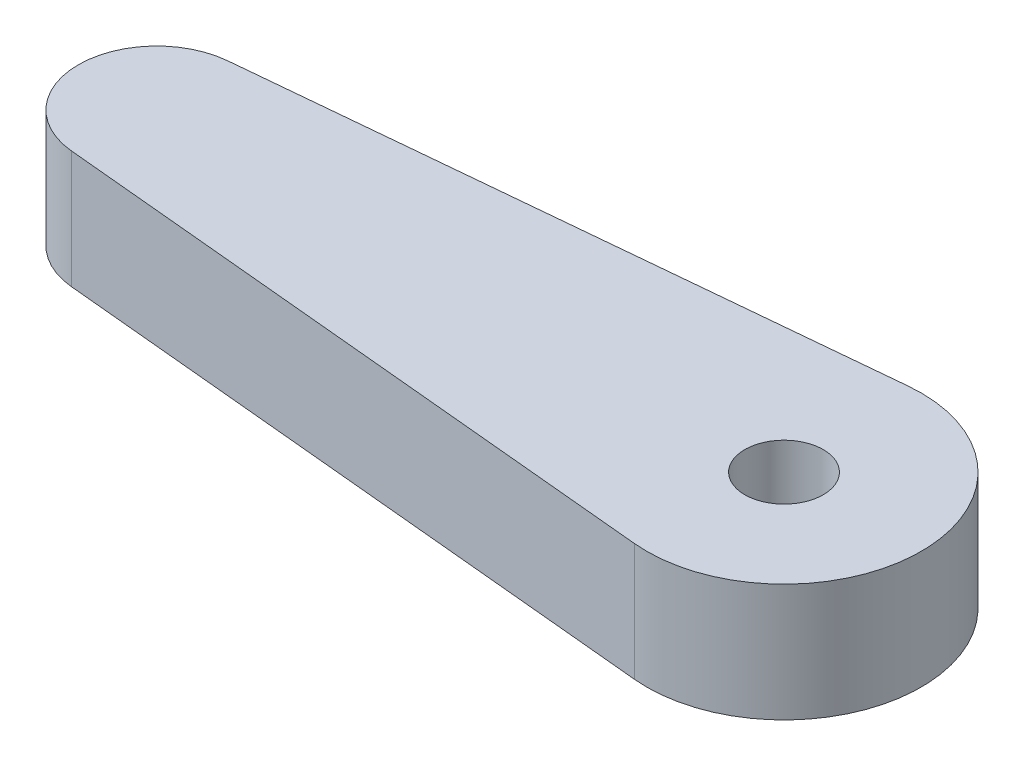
ISO-10303-21;
HEADER;
FILE_DESCRIPTION(('STEP AP214'),'2;1');
FILE_NAME('part.step','',(''),(''),'','','');
FILE_SCHEMA(('AUTOMOTIVE_DESIGN { 1 0 10303 214 1 1 1 1 }'));
ENDSEC;
DATA;
#1=APPLICATION_CONTEXT('core data for automotive mechanical design processes');
#2=APPLICATION_PROTOCOL_DEFINITION('international standard','automotive_design',2000,#1);
#3=PRODUCT_CONTEXT('',#1,'mechanical');
#4=PRODUCT('Part','Part','',(#3));
#5=PRODUCT_RELATED_PRODUCT_CATEGORY('part','',(#4));
#6=PRODUCT_DEFINITION_FORMATION('','',#4);
#7=PRODUCT_DEFINITION_CONTEXT('part definition',#1,'design');
#8=PRODUCT_DEFINITION('design','',#6,#7);
#9=PRODUCT_DEFINITION_SHAPE('','',#8);
#10=(LENGTH_UNIT() NAMED_UNIT(*) SI_UNIT(.MILLI.,.METRE.));
#11=(NAMED_UNIT(*) PLANE_ANGLE_UNIT() SI_UNIT($,.RADIAN.));
#12=(NAMED_UNIT(*) SI_UNIT($,.STERADIAN.) SOLID_ANGLE_UNIT());
#13=UNCERTAINTY_MEASURE_WITH_UNIT(LENGTH_MEASURE(1.E-05),#10,'distance_accuracy_value','');
#14=(GEOMETRIC_REPRESENTATION_CONTEXT(3) GLOBAL_UNCERTAINTY_ASSIGNED_CONTEXT((#13)) GLOBAL_UNIT_ASSIGNED_CONTEXT((#10,
#11,#12)) REPRESENTATION_CONTEXT('',''));
#15=CARTESIAN_POINT('',(0.,0.,0.));
#16=DIRECTION('',(0.,0.,1.));
#17=DIRECTION('',(1.,0.,0.));
#18=AXIS2_PLACEMENT_3D('',#15,#16,#17);
#19=CARTESIAN_POINT('',(0.,15.,0.));
#20=DIRECTION('',(0.,-1.,0.));
#21=DIRECTION('',(0.,0.,-1.));
#22=AXIS2_PLACEMENT_3D('',#19,#20,#21);
#23=CYLINDRICAL_SURFACE('',#22,10.);
#24=CARTESIAN_POINT('',(0.,0.,0.));
#25=DIRECTION('',(0.,1.,0.));
#26=DIRECTION('',(0.,0.,1.));
#27=AXIS2_PLACEMENT_3D('',#24,#25,#26);
#28=CIRCLE('',#27,10.);
#29=CARTESIAN_POINT('',(-0.937499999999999,0.,-9.95595770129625));
#30=VERTEX_POINT('',#29);
#31=CARTESIAN_POINT('',(-0.937499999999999,0.,9.95595770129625));
#32=VERTEX_POINT('',#31);
#33=EDGE_CURVE('E97',#30,#32,#28,.T.);
#34=ORIENTED_EDGE('',*,*,#33,.T.);
#35=DIRECTION('',(0.,-1.,0.));
#36=VECTOR('',#35,1.);
#37=CARTESIAN_POINT('',(-0.937499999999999,15.,9.95595770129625));
#38=LINE('',#37,#36);
#39=CARTESIAN_POINT('',(-0.937499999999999,15.,9.95595770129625));
#40=VERTEX_POINT('',#39);
#41=EDGE_CURVE('E11',#40,#32,#38,.T.);
#42=ORIENTED_EDGE('',*,*,#41,.F.);
#43=CARTESIAN_POINT('',(0.,15.,0.));
#44=DIRECTION('',(0.,1.,0.));
#45=DIRECTION('',(0.,0.,1.));
#46=AXIS2_PLACEMENT_3D('',#43,#44,#45);
#47=CIRCLE('',#46,10.);
#48=CARTESIAN_POINT('',(-0.937499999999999,15.,-9.95595770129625));
#49=VERTEX_POINT('',#48);
#50=EDGE_CURVE('E85',#49,#40,#47,.T.);
#51=ORIENTED_EDGE('',*,*,#50,.F.);
#52=DIRECTION('',(0.,-1.,0.));
#53=VECTOR('',#52,1.);
#54=CARTESIAN_POINT('',(-0.937499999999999,15.,-9.95595770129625));
#55=LINE('',#54,#53);
#56=EDGE_CURVE('E93',#49,#30,#55,.T.);
#57=ORIENTED_EDGE('',*,*,#56,.T.);
#58=EDGE_LOOP('',(#34,#42,#51,#57));
#59=FACE_BOUND('',#58,.T.);
#60=ADVANCED_FACE('F34',(#59),#23,.T.);
#61=CARTESIAN_POINT('',(-0.937499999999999,15.,9.95595770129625));
#62=DIRECTION('',(0.09375,0.,-0.995595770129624));
#63=DIRECTION('',(-0.995595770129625,0.,-0.0937500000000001));
#64=AXIS2_PLACEMENT_3D('',#61,#62,#63);
#65=PLANE('',#64);
#66=DIRECTION('',(0.995595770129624,0.,0.09375));
#67=VECTOR('',#66,1.);
#68=CARTESIAN_POINT('',(-0.937499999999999,0.,9.95595770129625));
#69=LINE('',#68,#67);
#70=CARTESIAN_POINT('',(78.359375,0.,17.4229259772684));
#71=VERTEX_POINT('',#70);
#72=EDGE_CURVE('E89',#32,#71,#69,.T.);
#73=ORIENTED_EDGE('',*,*,#72,.T.);
#74=DIRECTION('',(0.,-1.,0.));
#75=VECTOR('',#74,1.);
#76=CARTESIAN_POINT('',(78.359375,15.,17.4229259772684));
#77=LINE('',#76,#75);
#78=CARTESIAN_POINT('',(78.359375,15.,17.4229259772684));
#79=VERTEX_POINT('',#78);
#80=EDGE_CURVE('E42',#79,#71,#77,.T.);
#81=ORIENTED_EDGE('',*,*,#80,.F.);
#82=DIRECTION('',(0.995595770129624,0.,0.09375));
#83=VECTOR('',#82,1.);
#84=CARTESIAN_POINT('',(-0.937499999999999,15.,9.95595770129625));
#85=LINE('',#84,#83);
#86=EDGE_CURVE('E80',#40,#79,#85,.T.);
#87=ORIENTED_EDGE('',*,*,#86,.F.);
#88=ORIENTED_EDGE('',*,*,#41,.T.);
#89=EDGE_LOOP('',(#73,#81,#87,#88));
#90=FACE_BOUND('',#89,.T.);
#91=ADVANCED_FACE('F88',(#90),#65,.F.);
#92=CARTESIAN_POINT('',(80.,15.,0.));
#93=DIRECTION('',(0.,-1.,0.));
#94=DIRECTION('',(0.,0.,-1.));
#95=AXIS2_PLACEMENT_3D('',#92,#93,#94);
#96=CYLINDRICAL_SURFACE('',#95,17.5);
#97=CARTESIAN_POINT('',(80.,0.,0.));
#98=DIRECTION('',(0.,1.,0.));
#99=DIRECTION('',(0.,0.,1.));
#100=AXIS2_PLACEMENT_3D('',#97,#98,#99);
#101=CIRCLE('',#100,17.5);
#102=CARTESIAN_POINT('',(78.359375,0.,-17.4229259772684));
#103=VERTEX_POINT('',#102);
#104=EDGE_CURVE('E67',#71,#103,#101,.T.);
#105=ORIENTED_EDGE('',*,*,#104,.T.);
#106=DIRECTION('',(0.,-1.,0.));
#107=VECTOR('',#106,1.);
#108=CARTESIAN_POINT('',(78.359375,15.,-17.4229259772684));
#109=LINE('',#108,#107);
#110=CARTESIAN_POINT('',(78.359375,15.,-17.4229259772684));
#111=VERTEX_POINT('',#110);
#112=EDGE_CURVE('E90',#111,#103,#109,.T.);
#113=ORIENTED_EDGE('',*,*,#112,.F.);
#114=CARTESIAN_POINT('',(80.,15.,0.));
#115=DIRECTION('',(0.,1.,0.));
#116=DIRECTION('',(0.,0.,1.));
#117=AXIS2_PLACEMENT_3D('',#114,#115,#116);
#118=CIRCLE('',#117,17.5);
#119=EDGE_CURVE('E83',#79,#111,#118,.T.);
#120=ORIENTED_EDGE('',*,*,#119,.F.);
#121=ORIENTED_EDGE('',*,*,#80,.T.);
#122=EDGE_LOOP('',(#105,#113,#120,#121));
#123=FACE_BOUND('',#122,.T.);
#124=ADVANCED_FACE('F91',(#123),#96,.T.);
#125=CARTESIAN_POINT('',(-0.937499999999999,15.,-9.95595770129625));
#126=DIRECTION('',(0.09375,0.,0.995595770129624));
#127=DIRECTION('',(0.995595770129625,0.,-0.0937500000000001));
#128=AXIS2_PLACEMENT_3D('',#125,#126,#127);
#129=PLANE('',#128);
#130=DIRECTION('',(-0.995595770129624,0.,0.09375));
#131=VECTOR('',#130,1.);
#132=CARTESIAN_POINT('',(-0.937499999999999,0.,-9.95595770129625));
#133=LINE('',#132,#131);
#134=EDGE_CURVE('E73',#103,#30,#133,.T.);
#135=ORIENTED_EDGE('',*,*,#134,.T.);
#136=ORIENTED_EDGE('',*,*,#56,.F.);
#137=DIRECTION('',(-0.995595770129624,0.,0.09375));
#138=VECTOR('',#137,1.);
#139=CARTESIAN_POINT('',(-0.937499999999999,15.,-9.95595770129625));
#140=LINE('',#139,#138);
#141=EDGE_CURVE('E50',#111,#49,#140,.T.);
#142=ORIENTED_EDGE('',*,*,#141,.F.);
#143=ORIENTED_EDGE('',*,*,#112,.T.);
#144=EDGE_LOOP('',(#135,#136,#142,#143));
#145=FACE_BOUND('',#144,.T.);
#146=ADVANCED_FACE('F105',(#145),#129,.F.);
#147=CARTESIAN_POINT('',(0.,15.,0.));
#148=DIRECTION('',(0.,1.,0.));
#149=DIRECTION('',(0.,0.,1.));
#150=AXIS2_PLACEMENT_3D('',#147,#148,#149);
#151=PLANE('',#150);
#152=CARTESIAN_POINT('',(80.,15.,0.));
#153=DIRECTION('',(0.,1.,0.));
#154=DIRECTION('',(0.,0.,1.));
#155=AXIS2_PLACEMENT_3D('',#152,#153,#154);
#156=CIRCLE('',#155,5.);
#157=CARTESIAN_POINT('',(80.,15.,5.));
#158=VERTEX_POINT('',#157);
#159=EDGE_CURVE('E111',#158,#158,#156,.T.);
#160=ORIENTED_EDGE('',*,*,#159,.F.);
#161=EDGE_LOOP('',(#160));
#162=FACE_BOUND('',#161,.T.);
#163=ORIENTED_EDGE('',*,*,#50,.T.);
#164=ORIENTED_EDGE('',*,*,#86,.T.);
#165=ORIENTED_EDGE('',*,*,#119,.T.);
#166=ORIENTED_EDGE('',*,*,#141,.T.);
#167=EDGE_LOOP('',(#163,#164,#165,#166));
#168=FACE_BOUND('',#167,.T.);
#169=ADVANCED_FACE('F81',(#162,#168),#151,.T.);
#170=CARTESIAN_POINT('',(0.,0.,0.));
#171=DIRECTION('',(0.,1.,0.));
#172=DIRECTION('',(0.,0.,1.));
#173=AXIS2_PLACEMENT_3D('',#170,#171,#172);
#174=PLANE('',#173);
#175=CARTESIAN_POINT('',(0.,0.,0.));
#176=DIRECTION('',(0.,-1.,0.));
#177=DIRECTION('',(0.,0.,-1.));
#178=AXIS2_PLACEMENT_3D('',#175,#176,#177);
#179=CIRCLE('',#178,7.5);
#180=CARTESIAN_POINT('',(0.,0.,-7.5));
#181=VERTEX_POINT('',#180);
#182=EDGE_CURVE('E114',#181,#181,#179,.T.);
#183=ORIENTED_EDGE('',*,*,#182,.F.);
#184=EDGE_LOOP('',(#183));
#185=FACE_BOUND('',#184,.T.);
#186=CARTESIAN_POINT('',(80.,0.,0.));
#187=DIRECTION('',(0.,1.,0.));
#188=DIRECTION('',(0.,0.,1.));
#189=AXIS2_PLACEMENT_3D('',#186,#187,#188);
#190=CIRCLE('',#189,5.);
#191=CARTESIAN_POINT('',(80.,0.,5.));
#192=VERTEX_POINT('',#191);
#193=EDGE_CURVE('E100',#192,#192,#190,.T.);
#194=ORIENTED_EDGE('',*,*,#193,.T.);
#195=EDGE_LOOP('',(#194));
#196=FACE_BOUND('',#195,.T.);
#197=ORIENTED_EDGE('',*,*,#33,.F.);
#198=ORIENTED_EDGE('',*,*,#134,.F.);
#199=ORIENTED_EDGE('',*,*,#104,.F.);
#200=ORIENTED_EDGE('',*,*,#72,.F.);
#201=EDGE_LOOP('',(#197,#198,#199,#200));
#202=FACE_BOUND('',#201,.T.);
#203=ADVANCED_FACE('F108',(#185,#196,#202),#174,.F.);
#204=CARTESIAN_POINT('',(80.,0.,0.));
#205=DIRECTION('',(0.,1.,0.));
#206=DIRECTION('',(0.,0.,1.));
#207=AXIS2_PLACEMENT_3D('',#204,#205,#206);
#208=CYLINDRICAL_SURFACE('',#207,5.);
#209=ORIENTED_EDGE('',*,*,#193,.F.);
#210=EDGE_LOOP('',(#209));
#211=FACE_BOUND('',#210,.T.);
#212=ORIENTED_EDGE('',*,*,#159,.T.);
#213=EDGE_LOOP('',(#212));
#214=FACE_BOUND('',#213,.T.);
#215=ADVANCED_FACE('F124',(#211,#214),#208,.F.);
#216=CARTESIAN_POINT('',(0.,0.,0.));
#217=DIRECTION('',(0.,-1.,0.));
#218=DIRECTION('',(0.,0.,-1.));
#219=AXIS2_PLACEMENT_3D('',#216,#217,#218);
#220=SPHERICAL_SURFACE('',#219,7.5);
#221=ORIENTED_EDGE('',*,*,#182,.T.);
#222=EDGE_LOOP('',(#221));
#223=FACE_BOUND('',#222,.T.);
#224=ADVANCED_FACE('F120',(#223),#220,.F.);
#225=CLOSED_SHELL('',(#60,#91,#124,#146,#169,#203,#215,#224));
#226=MANIFOLD_SOLID_BREP('B2',#225);
#227=ADVANCED_BREP_SHAPE_REPRESENTATION('',(#18,#226),#14);
#228=SHAPE_DEFINITION_REPRESENTATION(#9,#227);
ENDSEC;
END-ISO-10303-21;
